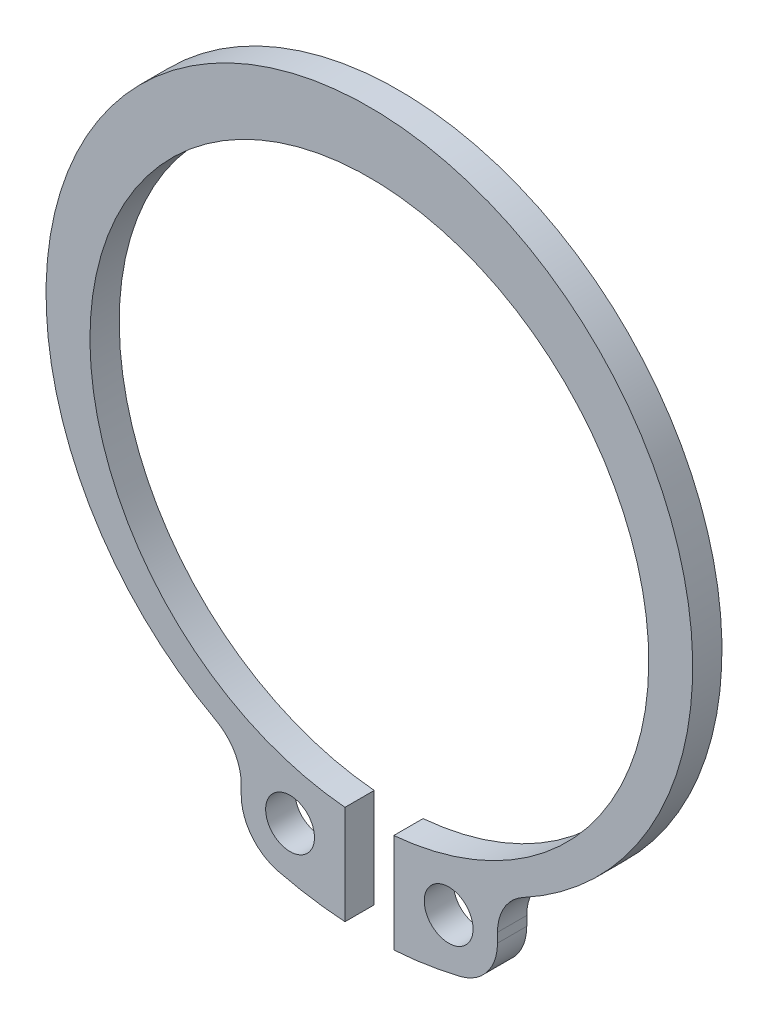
ISO-10303-21;
HEADER;
FILE_DESCRIPTION(('STEP AP214'),'2;1');
FILE_NAME('part.step','',(''),(''),'','','');
FILE_SCHEMA(('AUTOMOTIVE_DESIGN { 1 0 10303 214 1 1 1 1 }'));
ENDSEC;
DATA;
#1=APPLICATION_CONTEXT('core data for automotive mechanical design processes');
#2=APPLICATION_PROTOCOL_DEFINITION('international standard','automotive_design',2000,#1);
#3=PRODUCT_CONTEXT('',#1,'mechanical');
#4=PRODUCT('Part','Part','',(#3));
#5=PRODUCT_RELATED_PRODUCT_CATEGORY('part','',(#4));
#6=PRODUCT_DEFINITION_FORMATION('','',#4);
#7=PRODUCT_DEFINITION_CONTEXT('part definition',#1,'design');
#8=PRODUCT_DEFINITION('design','',#6,#7);
#9=PRODUCT_DEFINITION_SHAPE('','',#8);
#10=(LENGTH_UNIT() NAMED_UNIT(*) SI_UNIT(.MILLI.,.METRE.));
#11=(NAMED_UNIT(*) PLANE_ANGLE_UNIT() SI_UNIT($,.RADIAN.));
#12=(NAMED_UNIT(*) SI_UNIT($,.STERADIAN.) SOLID_ANGLE_UNIT());
#13=UNCERTAINTY_MEASURE_WITH_UNIT(LENGTH_MEASURE(1.E-05),#10,'distance_accuracy_value','');
#14=(GEOMETRIC_REPRESENTATION_CONTEXT(3) GLOBAL_UNCERTAINTY_ASSIGNED_CONTEXT((#13)) GLOBAL_UNIT_ASSIGNED_CONTEXT((#10,
#11,#12)) REPRESENTATION_CONTEXT('',''));
#15=CARTESIAN_POINT('',(0.,0.,0.));
#16=DIRECTION('',(0.,0.,1.));
#17=DIRECTION('',(1.,0.,0.));
#18=AXIS2_PLACEMENT_3D('',#15,#16,#17);
#19=CARTESIAN_POINT('',(3.25,-13.1029576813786,1.2));
#20=DIRECTION('',(0.,0.,1.));
#21=DIRECTION('',(1.,0.,0.));
#22=AXIS2_PLACEMENT_3D('',#19,#20,#21);
#23=PLANE('',#22);
#24=CARTESIAN_POINT('',(3.25,-13.1029576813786,1.2));
#25=DIRECTION('',(0.,0.,1.));
#26=DIRECTION('',(1.,0.,0.));
#27=AXIS2_PLACEMENT_3D('',#24,#25,#26);
#28=CIRCLE('',#27,1.);
#29=CARTESIAN_POINT('',(4.25,-13.1029576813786,1.2));
#30=VERTEX_POINT('',#29);
#31=EDGE_CURVE('E140',#30,#30,#28,.T.);
#32=ORIENTED_EDGE('',*,*,#31,.F.);
#33=EDGE_LOOP('',(#32));
#34=FACE_BOUND('',#33,.T.);
#35=CARTESIAN_POINT('',(3.25,-13.1029576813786,1.2));
#36=DIRECTION('',(0.,0.,1.));
#37=DIRECTION('',(1.,0.,0.));
#38=AXIS2_PLACEMENT_3D('',#35,#36,#37);
#39=CIRCLE('',#38,2.);
#40=CARTESIAN_POINT('',(3.73148148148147,-15.0441365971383,1.2));
#41=VERTEX_POINT('',#40);
#42=CARTESIAN_POINT('',(5.25,-13.1029576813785,1.2));
#43=VERTEX_POINT('',#42);
#44=EDGE_CURVE('E175',#41,#43,#39,.T.);
#45=ORIENTED_EDGE('',*,*,#44,.T.);
#46=DIRECTION('',(0.,-1.,0.));
#47=VECTOR('',#46,1.);
#48=CARTESIAN_POINT('',(5.25,-12.7164078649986,1.2));
#49=LINE('',#48,#47);
#50=CARTESIAN_POINT('',(5.25,-12.7164078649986,1.2));
#51=VERTEX_POINT('',#50);
#52=EDGE_CURVE('E131',#51,#43,#49,.T.);
#53=ORIENTED_EDGE('',*,*,#52,.F.);
#54=CARTESIAN_POINT('',(7.25000000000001,-12.7164078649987,1.2));
#55=DIRECTION('',(0.,0.,1.));
#56=DIRECTION('',(1.,0.,0.));
#57=AXIS2_PLACEMENT_3D('',#54,#55,#56);
#58=CIRCLE('',#57,2.);
#59=CARTESIAN_POINT('',(6.29918032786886,-10.956878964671,1.2));
#60=VERTEX_POINT('',#59);
#61=EDGE_CURVE('E178',#60,#51,#58,.T.);
#62=ORIENTED_EDGE('',*,*,#61,.F.);
#63=CARTESIAN_POINT('',(0.,0.699999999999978,1.2));
#64=DIRECTION('',(0.,0.,1.));
#65=DIRECTION('',(1.,0.,0.));
#66=AXIS2_PLACEMENT_3D('',#63,#64,#65);
#67=CIRCLE('',#66,13.25);
#68=CARTESIAN_POINT('',(-6.29918032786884,-10.9568789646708,1.2));
#69=VERTEX_POINT('',#68);
#70=EDGE_CURVE('E181',#60,#69,#67,.T.);
#71=ORIENTED_EDGE('',*,*,#70,.T.);
#72=CARTESIAN_POINT('',(-7.24999999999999,-12.7164078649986,1.2));
#73=DIRECTION('',(0.,0.,-1.));
#74=DIRECTION('',(-1.,0.,0.));
#75=AXIS2_PLACEMENT_3D('',#72,#73,#74);
#76=CIRCLE('',#75,2.);
#77=CARTESIAN_POINT('',(-5.24999999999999,-12.7164078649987,1.2));
#78=VERTEX_POINT('',#77);
#79=EDGE_CURVE('E183',#69,#78,#76,.T.);
#80=ORIENTED_EDGE('',*,*,#79,.T.);
#81=DIRECTION('',(0.,-1.,0.));
#82=VECTOR('',#81,1.);
#83=CARTESIAN_POINT('',(-5.24999999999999,-12.7164078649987,1.2));
#84=LINE('',#83,#82);
#85=CARTESIAN_POINT('',(-5.24999999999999,-13.1029576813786,1.2));
#86=VERTEX_POINT('',#85);
#87=EDGE_CURVE('E185',#78,#86,#84,.T.);
#88=ORIENTED_EDGE('',*,*,#87,.T.);
#89=CARTESIAN_POINT('',(-3.25,-13.1029576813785,1.2));
#90=DIRECTION('',(0.,0.,-1.));
#91=DIRECTION('',(-1.,0.,0.));
#92=AXIS2_PLACEMENT_3D('',#89,#90,#91);
#93=CIRCLE('',#92,2.);
#94=CARTESIAN_POINT('',(-3.73148148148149,-15.0441365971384,1.2));
#95=VERTEX_POINT('',#94);
#96=EDGE_CURVE('E187',#95,#86,#93,.T.);
#97=ORIENTED_EDGE('',*,*,#96,.F.);
#98=CARTESIAN_POINT('',(0.,0.,1.2));
#99=DIRECTION('',(0.,0.,1.));
#100=DIRECTION('',(1.,0.,0.));
#101=AXIS2_PLACEMENT_3D('',#98,#99,#100);
#102=CIRCLE('',#101,15.5);
#103=CARTESIAN_POINT('',(-1.,-15.4677082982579,1.2));
#104=VERTEX_POINT('',#103);
#105=EDGE_CURVE('E190',#95,#104,#102,.T.);
#106=ORIENTED_EDGE('',*,*,#105,.T.);
#107=DIRECTION('',(0.,-1.,0.));
#108=VECTOR('',#107,1.);
#109=CARTESIAN_POINT('',(-1.,-11.4062482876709,1.2));
#110=LINE('',#109,#108);
#111=CARTESIAN_POINT('',(-0.999999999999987,-11.4062482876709,1.2));
#112=VERTEX_POINT('',#111);
#113=EDGE_CURVE('E192',#112,#104,#110,.T.);
#114=ORIENTED_EDGE('',*,*,#113,.F.);
#115=CARTESIAN_POINT('',(0.,0.,1.2));
#116=DIRECTION('',(0.,0.,1.));
#117=DIRECTION('',(1.,0.,0.));
#118=AXIS2_PLACEMENT_3D('',#115,#116,#117);
#119=CIRCLE('',#118,11.45);
#120=CARTESIAN_POINT('',(1.,-11.4062482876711,1.2));
#121=VERTEX_POINT('',#120);
#122=EDGE_CURVE('E195',#121,#112,#119,.T.);
#123=ORIENTED_EDGE('',*,*,#122,.F.);
#124=DIRECTION('',(0.,-1.,0.));
#125=VECTOR('',#124,1.);
#126=CARTESIAN_POINT('',(1.,-11.4062482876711,1.2));
#127=LINE('',#126,#125);
#128=CARTESIAN_POINT('',(1.,-15.467708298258,1.2));
#129=VERTEX_POINT('',#128);
#130=EDGE_CURVE('E56',#121,#129,#127,.T.);
#131=ORIENTED_EDGE('',*,*,#130,.T.);
#132=CARTESIAN_POINT('',(0.,0.,1.2));
#133=DIRECTION('',(0.,0.,1.));
#134=DIRECTION('',(1.,0.,0.));
#135=AXIS2_PLACEMENT_3D('',#132,#133,#134);
#136=CIRCLE('',#135,15.5);
#137=EDGE_CURVE('E51',#129,#41,#136,.T.);
#138=ORIENTED_EDGE('',*,*,#137,.T.);
#139=EDGE_LOOP('',(#45,#53,#62,#71,#80,#88,#97,#106,#114,#123,#131,#138));
#140=FACE_BOUND('',#139,.T.);
#141=CARTESIAN_POINT('',(-3.25,-13.1029576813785,1.2));
#142=DIRECTION('',(0.,0.,1.));
#143=DIRECTION('',(1.,0.,0.));
#144=AXIS2_PLACEMENT_3D('',#141,#142,#143);
#145=CIRCLE('',#144,1.);
#146=CARTESIAN_POINT('',(-2.25,-13.1029576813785,1.2));
#147=VERTEX_POINT('',#146);
#148=EDGE_CURVE('E288',#147,#147,#145,.T.);
#149=ORIENTED_EDGE('',*,*,#148,.F.);
#150=EDGE_LOOP('',(#149));
#151=FACE_BOUND('',#150,.T.);
#152=ADVANCED_FACE('F36',(#34,#140,#151),#23,.T.);
#153=CARTESIAN_POINT('',(3.25,-13.1029576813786,0.));
#154=DIRECTION('',(0.,0.,1.));
#155=DIRECTION('',(1.,0.,0.));
#156=AXIS2_PLACEMENT_3D('',#153,#154,#155);
#157=PLANE('',#156);
#158=CARTESIAN_POINT('',(3.25,-13.1029576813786,0.));
#159=DIRECTION('',(0.,0.,1.));
#160=DIRECTION('',(1.,0.,0.));
#161=AXIS2_PLACEMENT_3D('',#158,#159,#160);
#162=CIRCLE('',#161,1.);
#163=CARTESIAN_POINT('',(4.25,-13.1029576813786,0.));
#164=VERTEX_POINT('',#163);
#165=EDGE_CURVE('E293',#164,#164,#162,.T.);
#166=ORIENTED_EDGE('',*,*,#165,.T.);
#167=EDGE_LOOP('',(#166));
#168=FACE_BOUND('',#167,.T.);
#169=CARTESIAN_POINT('',(3.25,-13.1029576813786,0.));
#170=DIRECTION('',(0.,0.,1.));
#171=DIRECTION('',(1.,0.,0.));
#172=AXIS2_PLACEMENT_3D('',#169,#170,#171);
#173=CIRCLE('',#172,2.);
#174=CARTESIAN_POINT('',(3.73148148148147,-15.0441365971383,0.));
#175=VERTEX_POINT('',#174);
#176=CARTESIAN_POINT('',(5.25,-13.1029576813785,0.));
#177=VERTEX_POINT('',#176);
#178=EDGE_CURVE('E136',#175,#177,#173,.T.);
#179=ORIENTED_EDGE('',*,*,#178,.F.);
#180=CARTESIAN_POINT('',(0.,0.,0.));
#181=DIRECTION('',(0.,0.,1.));
#182=DIRECTION('',(1.,0.,0.));
#183=AXIS2_PLACEMENT_3D('',#180,#181,#182);
#184=CIRCLE('',#183,15.5);
#185=CARTESIAN_POINT('',(1.,-15.467708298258,0.));
#186=VERTEX_POINT('',#185);
#187=EDGE_CURVE('E173',#186,#175,#184,.T.);
#188=ORIENTED_EDGE('',*,*,#187,.F.);
#189=DIRECTION('',(0.,-1.,0.));
#190=VECTOR('',#189,1.);
#191=CARTESIAN_POINT('',(1.,-11.4062482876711,0.));
#192=LINE('',#191,#190);
#193=CARTESIAN_POINT('',(1.,-11.4062482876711,0.));
#194=VERTEX_POINT('',#193);
#195=EDGE_CURVE('E171',#194,#186,#192,.T.);
#196=ORIENTED_EDGE('',*,*,#195,.F.);
#197=CARTESIAN_POINT('',(0.,0.,0.));
#198=DIRECTION('',(0.,0.,1.));
#199=DIRECTION('',(1.,0.,0.));
#200=AXIS2_PLACEMENT_3D('',#197,#198,#199);
#201=CIRCLE('',#200,11.45);
#202=CARTESIAN_POINT('',(-0.999999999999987,-11.4062482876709,0.));
#203=VERTEX_POINT('',#202);
#204=EDGE_CURVE('E167',#194,#203,#201,.T.);
#205=ORIENTED_EDGE('',*,*,#204,.T.);
#206=DIRECTION('',(0.,-1.,0.));
#207=VECTOR('',#206,1.);
#208=CARTESIAN_POINT('',(-1.,-11.4062482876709,0.));
#209=LINE('',#208,#207);
#210=CARTESIAN_POINT('',(-1.,-15.4677082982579,0.));
#211=VERTEX_POINT('',#210);
#212=EDGE_CURVE('E164',#203,#211,#209,.T.);
#213=ORIENTED_EDGE('',*,*,#212,.T.);
#214=CARTESIAN_POINT('',(0.,0.,0.));
#215=DIRECTION('',(0.,0.,1.));
#216=DIRECTION('',(1.,0.,0.));
#217=AXIS2_PLACEMENT_3D('',#214,#215,#216);
#218=CIRCLE('',#217,15.5);
#219=CARTESIAN_POINT('',(-3.73148148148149,-15.0441365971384,0.));
#220=VERTEX_POINT('',#219);
#221=EDGE_CURVE('E161',#220,#211,#218,.T.);
#222=ORIENTED_EDGE('',*,*,#221,.F.);
#223=CARTESIAN_POINT('',(-3.25,-13.1029576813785,0.));
#224=DIRECTION('',(0.,0.,-1.));
#225=DIRECTION('',(-1.,0.,0.));
#226=AXIS2_PLACEMENT_3D('',#223,#224,#225);
#227=CIRCLE('',#226,2.);
#228=CARTESIAN_POINT('',(-5.24999999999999,-13.1029576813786,0.));
#229=VERTEX_POINT('',#228);
#230=EDGE_CURVE('E158',#220,#229,#227,.T.);
#231=ORIENTED_EDGE('',*,*,#230,.T.);
#232=DIRECTION('',(0.,-1.,0.));
#233=VECTOR('',#232,1.);
#234=CARTESIAN_POINT('',(-5.24999999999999,-12.7164078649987,0.));
#235=LINE('',#234,#233);
#236=CARTESIAN_POINT('',(-5.24999999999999,-12.7164078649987,0.));
#237=VERTEX_POINT('',#236);
#238=EDGE_CURVE('E155',#237,#229,#235,.T.);
#239=ORIENTED_EDGE('',*,*,#238,.F.);
#240=CARTESIAN_POINT('',(-7.24999999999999,-12.7164078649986,0.));
#241=DIRECTION('',(0.,0.,-1.));
#242=DIRECTION('',(-1.,0.,0.));
#243=AXIS2_PLACEMENT_3D('',#240,#241,#242);
#244=CIRCLE('',#243,2.);
#245=CARTESIAN_POINT('',(-6.29918032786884,-10.9568789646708,0.));
#246=VERTEX_POINT('',#245);
#247=EDGE_CURVE('E153',#246,#237,#244,.T.);
#248=ORIENTED_EDGE('',*,*,#247,.F.);
#249=CARTESIAN_POINT('',(0.,0.699999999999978,0.));
#250=DIRECTION('',(0.,0.,1.));
#251=DIRECTION('',(1.,0.,0.));
#252=AXIS2_PLACEMENT_3D('',#249,#250,#251);
#253=CIRCLE('',#252,13.25);
#254=CARTESIAN_POINT('',(6.29918032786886,-10.956878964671,0.));
#255=VERTEX_POINT('',#254);
#256=EDGE_CURVE('E148',#255,#246,#253,.T.);
#257=ORIENTED_EDGE('',*,*,#256,.F.);
#258=CARTESIAN_POINT('',(7.25000000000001,-12.7164078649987,0.));
#259=DIRECTION('',(0.,0.,1.));
#260=DIRECTION('',(1.,0.,0.));
#261=AXIS2_PLACEMENT_3D('',#258,#259,#260);
#262=CIRCLE('',#261,2.);
#263=CARTESIAN_POINT('',(5.25,-12.7164078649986,0.));
#264=VERTEX_POINT('',#263);
#265=EDGE_CURVE('E146',#255,#264,#262,.T.);
#266=ORIENTED_EDGE('',*,*,#265,.T.);
#267=DIRECTION('',(0.,-1.,0.));
#268=VECTOR('',#267,1.);
#269=CARTESIAN_POINT('',(5.25,-12.7164078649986,0.));
#270=LINE('',#269,#268);
#271=EDGE_CURVE('E128',#264,#177,#270,.T.);
#272=ORIENTED_EDGE('',*,*,#271,.T.);
#273=EDGE_LOOP('',(#179,#188,#196,#205,#213,#222,#231,#239,#248,#257,#266,#272));
#274=FACE_BOUND('',#273,.T.);
#275=CARTESIAN_POINT('',(-3.25,-13.1029576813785,0.));
#276=DIRECTION('',(0.,0.,1.));
#277=DIRECTION('',(1.,0.,0.));
#278=AXIS2_PLACEMENT_3D('',#275,#276,#277);
#279=CIRCLE('',#278,1.);
#280=CARTESIAN_POINT('',(-2.25,-13.1029576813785,0.));
#281=VERTEX_POINT('',#280);
#282=EDGE_CURVE('E291',#281,#281,#279,.T.);
#283=ORIENTED_EDGE('',*,*,#282,.T.);
#284=EDGE_LOOP('',(#283));
#285=FACE_BOUND('',#284,.T.);
#286=ADVANCED_FACE('F142',(#168,#274,#285),#157,.F.);
#287=CARTESIAN_POINT('',(3.25,-13.1029576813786,1.2));
#288=DIRECTION('',(0.,0.,-1.));
#289=DIRECTION('',(-1.,0.,0.));
#290=AXIS2_PLACEMENT_3D('',#287,#288,#289);
#291=CYLINDRICAL_SURFACE('',#290,2.);
#292=ORIENTED_EDGE('',*,*,#178,.T.);
#293=DIRECTION('',(0.,0.,-1.));
#294=VECTOR('',#293,1.);
#295=CARTESIAN_POINT('',(5.25,-13.1029576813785,1.2));
#296=LINE('',#295,#294);
#297=EDGE_CURVE('E11',#43,#177,#296,.T.);
#298=ORIENTED_EDGE('',*,*,#297,.F.);
#299=ORIENTED_EDGE('',*,*,#44,.F.);
#300=DIRECTION('',(0.,0.,-1.));
#301=VECTOR('',#300,1.);
#302=CARTESIAN_POINT('',(3.73148148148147,-15.0441365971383,1.2));
#303=LINE('',#302,#301);
#304=EDGE_CURVE('E137',#41,#175,#303,.T.);
#305=ORIENTED_EDGE('',*,*,#304,.T.);
#306=EDGE_LOOP('',(#292,#298,#299,#305));
#307=FACE_BOUND('',#306,.T.);
#308=ADVANCED_FACE('F38',(#307),#291,.T.);
#309=CARTESIAN_POINT('',(5.25,-12.7164078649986,1.2));
#310=DIRECTION('',(1.,0.,0.));
#311=DIRECTION('',(0.,0.,-1.));
#312=AXIS2_PLACEMENT_3D('',#309,#310,#311);
#313=PLANE('',#312);
#314=ORIENTED_EDGE('',*,*,#271,.F.);
#315=DIRECTION('',(0.,0.,-1.));
#316=VECTOR('',#315,1.);
#317=CARTESIAN_POINT('',(5.25,-12.7164078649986,1.2));
#318=LINE('',#317,#316);
#319=EDGE_CURVE('E44',#51,#264,#318,.T.);
#320=ORIENTED_EDGE('',*,*,#319,.F.);
#321=ORIENTED_EDGE('',*,*,#52,.T.);
#322=ORIENTED_EDGE('',*,*,#297,.T.);
#323=EDGE_LOOP('',(#314,#320,#321,#322));
#324=FACE_BOUND('',#323,.T.);
#325=ADVANCED_FACE('F126',(#324),#313,.T.);
#326=CARTESIAN_POINT('',(7.25000000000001,-12.7164078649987,1.2));
#327=DIRECTION('',(0.,0.,-1.));
#328=DIRECTION('',(-1.,0.,0.));
#329=AXIS2_PLACEMENT_3D('',#326,#327,#328);
#330=CYLINDRICAL_SURFACE('',#329,2.);
#331=ORIENTED_EDGE('',*,*,#265,.F.);
#332=DIRECTION('',(0.,0.,-1.));
#333=VECTOR('',#332,1.);
#334=CARTESIAN_POINT('',(6.29918032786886,-10.956878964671,1.2));
#335=LINE('',#334,#333);
#336=EDGE_CURVE('E220',#60,#255,#335,.T.);
#337=ORIENTED_EDGE('',*,*,#336,.F.);
#338=ORIENTED_EDGE('',*,*,#61,.T.);
#339=ORIENTED_EDGE('',*,*,#319,.T.);
#340=EDGE_LOOP('',(#331,#337,#338,#339));
#341=FACE_BOUND('',#340,.T.);
#342=ADVANCED_FACE('F222',(#341),#330,.F.);
#343=CARTESIAN_POINT('',(0.,0.699999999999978,1.2));
#344=DIRECTION('',(0.,0.,-1.));
#345=DIRECTION('',(-1.,0.,0.));
#346=AXIS2_PLACEMENT_3D('',#343,#344,#345);
#347=CYLINDRICAL_SURFACE('',#346,13.25);
#348=ORIENTED_EDGE('',*,*,#256,.T.);
#349=DIRECTION('',(0.,0.,-1.));
#350=VECTOR('',#349,1.);
#351=CARTESIAN_POINT('',(-6.29918032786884,-10.9568789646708,1.2));
#352=LINE('',#351,#350);
#353=EDGE_CURVE('E217',#69,#246,#352,.T.);
#354=ORIENTED_EDGE('',*,*,#353,.F.);
#355=ORIENTED_EDGE('',*,*,#70,.F.);
#356=ORIENTED_EDGE('',*,*,#336,.T.);
#357=EDGE_LOOP('',(#348,#354,#355,#356));
#358=FACE_BOUND('',#357,.T.);
#359=ADVANCED_FACE('F230',(#358),#347,.T.);
#360=CARTESIAN_POINT('',(-7.24999999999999,-12.7164078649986,1.2));
#361=DIRECTION('',(0.,0.,-1.));
#362=DIRECTION('',(-1.,0.,0.));
#363=AXIS2_PLACEMENT_3D('',#360,#361,#362);
#364=CYLINDRICAL_SURFACE('',#363,2.);
#365=ORIENTED_EDGE('',*,*,#247,.T.);
#366=DIRECTION('',(0.,0.,-1.));
#367=VECTOR('',#366,1.);
#368=CARTESIAN_POINT('',(-5.24999999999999,-12.7164078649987,1.2));
#369=LINE('',#368,#367);
#370=EDGE_CURVE('E214',#78,#237,#369,.T.);
#371=ORIENTED_EDGE('',*,*,#370,.F.);
#372=ORIENTED_EDGE('',*,*,#79,.F.);
#373=ORIENTED_EDGE('',*,*,#353,.T.);
#374=EDGE_LOOP('',(#365,#371,#372,#373));
#375=FACE_BOUND('',#374,.T.);
#376=ADVANCED_FACE('F233',(#375),#364,.F.);
#377=CARTESIAN_POINT('',(-5.24999999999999,-12.7164078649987,1.2));
#378=DIRECTION('',(1.,0.,0.));
#379=DIRECTION('',(0.,0.,-1.));
#380=AXIS2_PLACEMENT_3D('',#377,#378,#379);
#381=PLANE('',#380);
#382=ORIENTED_EDGE('',*,*,#238,.T.);
#383=DIRECTION('',(0.,0.,-1.));
#384=VECTOR('',#383,1.);
#385=CARTESIAN_POINT('',(-5.24999999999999,-13.1029576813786,1.2));
#386=LINE('',#385,#384);
#387=EDGE_CURVE('E212',#86,#229,#386,.T.);
#388=ORIENTED_EDGE('',*,*,#387,.F.);
#389=ORIENTED_EDGE('',*,*,#87,.F.);
#390=ORIENTED_EDGE('',*,*,#370,.T.);
#391=EDGE_LOOP('',(#382,#388,#389,#390));
#392=FACE_BOUND('',#391,.T.);
#393=ADVANCED_FACE('F238',(#392),#381,.F.);
#394=CARTESIAN_POINT('',(-3.25,-13.1029576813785,1.2));
#395=DIRECTION('',(0.,0.,-1.));
#396=DIRECTION('',(-1.,0.,0.));
#397=AXIS2_PLACEMENT_3D('',#394,#395,#396);
#398=CYLINDRICAL_SURFACE('',#397,2.);
#399=ORIENTED_EDGE('',*,*,#230,.F.);
#400=DIRECTION('',(0.,0.,-1.));
#401=VECTOR('',#400,1.);
#402=CARTESIAN_POINT('',(-3.73148148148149,-15.0441365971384,1.2));
#403=LINE('',#402,#401);
#404=EDGE_CURVE('E210',#95,#220,#403,.T.);
#405=ORIENTED_EDGE('',*,*,#404,.F.);
#406=ORIENTED_EDGE('',*,*,#96,.T.);
#407=ORIENTED_EDGE('',*,*,#387,.T.);
#408=EDGE_LOOP('',(#399,#405,#406,#407));
#409=FACE_BOUND('',#408,.T.);
#410=ADVANCED_FACE('F245',(#409),#398,.T.);
#411=CARTESIAN_POINT('',(0.,0.,1.2));
#412=DIRECTION('',(0.,0.,-1.));
#413=DIRECTION('',(-1.,0.,0.));
#414=AXIS2_PLACEMENT_3D('',#411,#412,#413);
#415=CYLINDRICAL_SURFACE('',#414,15.5);
#416=ORIENTED_EDGE('',*,*,#221,.T.);
#417=DIRECTION('',(0.,0.,-1.));
#418=VECTOR('',#417,1.);
#419=CARTESIAN_POINT('',(-1.,-15.4677082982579,1.2));
#420=LINE('',#419,#418);
#421=EDGE_CURVE('E208',#104,#211,#420,.T.);
#422=ORIENTED_EDGE('',*,*,#421,.F.);
#423=ORIENTED_EDGE('',*,*,#105,.F.);
#424=ORIENTED_EDGE('',*,*,#404,.T.);
#425=EDGE_LOOP('',(#416,#422,#423,#424));
#426=FACE_BOUND('',#425,.T.);
#427=ADVANCED_FACE('F248',(#426),#415,.T.);
#428=CARTESIAN_POINT('',(-1.,-11.4062482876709,1.2));
#429=DIRECTION('',(1.,0.,0.));
#430=DIRECTION('',(0.,0.,-1.));
#431=AXIS2_PLACEMENT_3D('',#428,#429,#430);
#432=PLANE('',#431);
#433=ORIENTED_EDGE('',*,*,#212,.F.);
#434=DIRECTION('',(0.,0.,-1.));
#435=VECTOR('',#434,1.);
#436=CARTESIAN_POINT('',(-0.999999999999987,-11.4062482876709,1.2));
#437=LINE('',#436,#435);
#438=EDGE_CURVE('E206',#112,#203,#437,.T.);
#439=ORIENTED_EDGE('',*,*,#438,.F.);
#440=ORIENTED_EDGE('',*,*,#113,.T.);
#441=ORIENTED_EDGE('',*,*,#421,.T.);
#442=EDGE_LOOP('',(#433,#439,#440,#441));
#443=FACE_BOUND('',#442,.T.);
#444=ADVANCED_FACE('F251',(#443),#432,.T.);
#445=CARTESIAN_POINT('',(0.,0.,1.2));
#446=DIRECTION('',(0.,0.,-1.));
#447=DIRECTION('',(-1.,0.,0.));
#448=AXIS2_PLACEMENT_3D('',#445,#446,#447);
#449=CYLINDRICAL_SURFACE('',#448,11.45);
#450=ORIENTED_EDGE('',*,*,#204,.F.);
#451=DIRECTION('',(0.,0.,-1.));
#452=VECTOR('',#451,1.);
#453=CARTESIAN_POINT('',(1.,-11.4062482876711,1.2));
#454=LINE('',#453,#452);
#455=EDGE_CURVE('E204',#121,#194,#454,.T.);
#456=ORIENTED_EDGE('',*,*,#455,.F.);
#457=ORIENTED_EDGE('',*,*,#122,.T.);
#458=ORIENTED_EDGE('',*,*,#438,.T.);
#459=EDGE_LOOP('',(#450,#456,#457,#458));
#460=FACE_BOUND('',#459,.T.);
#461=ADVANCED_FACE('F254',(#460),#449,.F.);
#462=CARTESIAN_POINT('',(1.,-11.4062482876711,1.2));
#463=DIRECTION('',(1.,0.,0.));
#464=DIRECTION('',(0.,0.,-1.));
#465=AXIS2_PLACEMENT_3D('',#462,#463,#464);
#466=PLANE('',#465);
#467=ORIENTED_EDGE('',*,*,#195,.T.);
#468=DIRECTION('',(0.,0.,-1.));
#469=VECTOR('',#468,1.);
#470=CARTESIAN_POINT('',(1.,-15.467708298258,1.2));
#471=LINE('',#470,#469);
#472=EDGE_CURVE('E201',#129,#186,#471,.T.);
#473=ORIENTED_EDGE('',*,*,#472,.F.);
#474=ORIENTED_EDGE('',*,*,#130,.F.);
#475=ORIENTED_EDGE('',*,*,#455,.T.);
#476=EDGE_LOOP('',(#467,#473,#474,#475));
#477=FACE_BOUND('',#476,.T.);
#478=ADVANCED_FACE('F257',(#477),#466,.F.);
#479=CARTESIAN_POINT('',(0.,0.,1.2));
#480=DIRECTION('',(0.,0.,-1.));
#481=DIRECTION('',(-1.,0.,0.));
#482=AXIS2_PLACEMENT_3D('',#479,#480,#481);
#483=CYLINDRICAL_SURFACE('',#482,15.5);
#484=ORIENTED_EDGE('',*,*,#187,.T.);
#485=ORIENTED_EDGE('',*,*,#304,.F.);
#486=ORIENTED_EDGE('',*,*,#137,.F.);
#487=ORIENTED_EDGE('',*,*,#472,.T.);
#488=EDGE_LOOP('',(#484,#485,#486,#487));
#489=FACE_BOUND('',#488,.T.);
#490=ADVANCED_FACE('F259',(#489),#483,.T.);
#491=CARTESIAN_POINT('',(3.25,-13.1029576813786,1.2));
#492=DIRECTION('',(0.,0.,-1.));
#493=DIRECTION('',(-1.,0.,0.));
#494=AXIS2_PLACEMENT_3D('',#491,#492,#493);
#495=CYLINDRICAL_SURFACE('',#494,1.);
#496=ORIENTED_EDGE('',*,*,#31,.T.);
#497=EDGE_LOOP('',(#496));
#498=FACE_BOUND('',#497,.T.);
#499=ORIENTED_EDGE('',*,*,#165,.F.);
#500=EDGE_LOOP('',(#499));
#501=FACE_BOUND('',#500,.T.);
#502=ADVANCED_FACE('F261',(#498,#501),#495,.F.);
#503=CARTESIAN_POINT('',(-3.25,-13.1029576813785,1.2));
#504=DIRECTION('',(0.,0.,-1.));
#505=DIRECTION('',(-1.,0.,0.));
#506=AXIS2_PLACEMENT_3D('',#503,#504,#505);
#507=CYLINDRICAL_SURFACE('',#506,1.);
#508=ORIENTED_EDGE('',*,*,#148,.T.);
#509=EDGE_LOOP('',(#508));
#510=FACE_BOUND('',#509,.T.);
#511=ORIENTED_EDGE('',*,*,#282,.F.);
#512=EDGE_LOOP('',(#511));
#513=FACE_BOUND('',#512,.T.);
#514=ADVANCED_FACE('F267',(#510,#513),#507,.F.);
#515=CLOSED_SHELL('',(#152,#286,#308,#325,#342,#359,#376,#393,#410,#427,#444,#461,#478,#490,
#502,#514));
#516=MANIFOLD_SOLID_BREP('B2',#515);
#517=ADVANCED_BREP_SHAPE_REPRESENTATION('',(#18,#516),#14);
#518=SHAPE_DEFINITION_REPRESENTATION(#9,#517);
ENDSEC;
END-ISO-10303-21;
